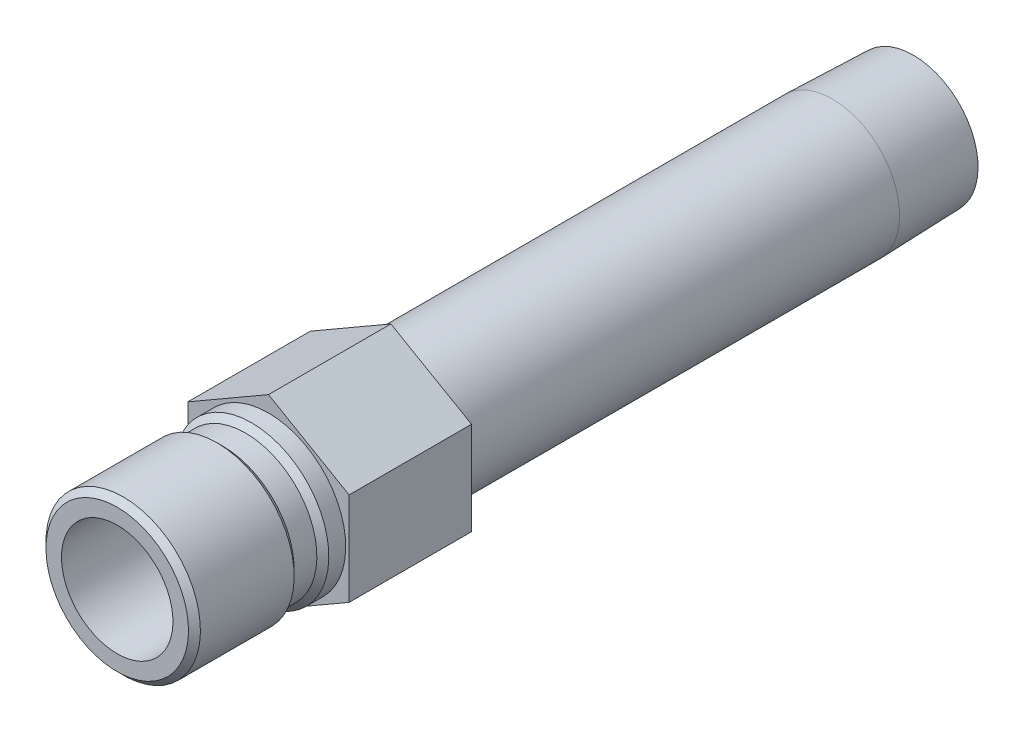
from build123d import *

# Parameters (mm, degrees)
SKETCH2_R           = 7.112
BOSS_EXTRUDE1_DEPTH = 15.621


with BuildPart() as part:
    # Sketch1 → Revolve1 (revolve)
    with BuildSketch(Plane(origin=(0, 0, 0), x_dir=(0, 0, -1), z_dir=(1, 0, 0))):
        Polygon((-19.304, 7.112), (-19.304, 9.0932), (-18.542, 9.8552), (-6.5786, 9.8552), (-5.8166, 9.0932), (-2.921, 9.0932), (-2.159, 9.8552), (0, 9.8552), (0, 8.5725), (71.9582, 8.5725), (82.296, 8.249445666), (82.296, 6.2611), (-1.071568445, 6.2611), (-1.524, 7.112), align=None)
    revolve(axis=Axis((0, 0, 0), (0, 0, 1)))

    # Sketch2 → Boss-Extrude1 (add)
    with BuildSketch(Plane.XY):
        Polygon((-10.287, 5.939202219), (-10.287, -5.939202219), (0, -11.878404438), (10.287, -5.939202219), (10.287, 5.939202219), (0, 11.878404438), align=None)
        with Locations(Location((0, 0, 0), (0, 0, 90))):
            Circle(SKETCH2_R, mode=Mode.SUBTRACT)
    extrude(amount=-BOSS_EXTRUDE1_DEPTH)


solid = part.part
